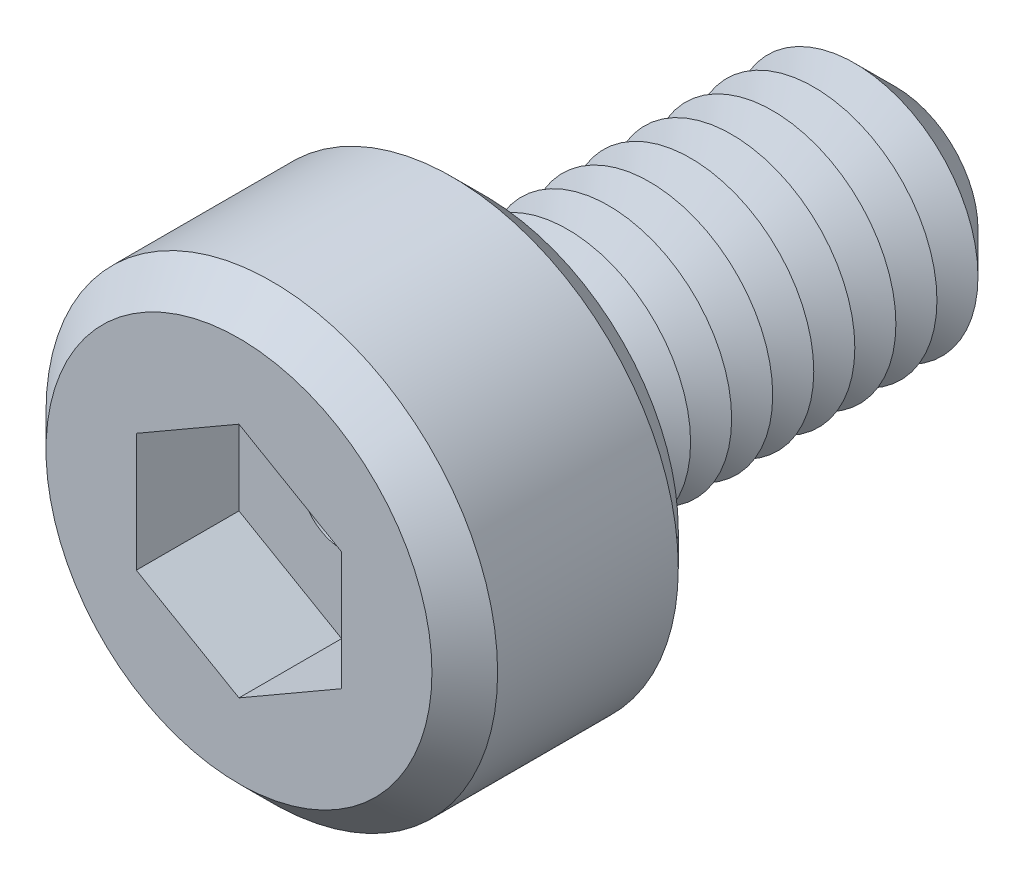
ISO-10303-21;
HEADER;
FILE_DESCRIPTION(('STEP AP214'),'2;1');
FILE_NAME('part.step','',(''),(''),'','','');
FILE_SCHEMA(('AUTOMOTIVE_DESIGN { 1 0 10303 214 1 1 1 1 }'));
ENDSEC;
DATA;
#1=APPLICATION_CONTEXT('core data for automotive mechanical design processes');
#2=APPLICATION_PROTOCOL_DEFINITION('international standard','automotive_design',2000,#1);
#3=PRODUCT_CONTEXT('',#1,'mechanical');
#4=PRODUCT('Part','Part','',(#3));
#5=PRODUCT_RELATED_PRODUCT_CATEGORY('part','',(#4));
#6=PRODUCT_DEFINITION_FORMATION('','',#4);
#7=PRODUCT_DEFINITION_CONTEXT('part definition',#1,'design');
#8=PRODUCT_DEFINITION('design','',#6,#7);
#9=PRODUCT_DEFINITION_SHAPE('','',#8);
#10=(LENGTH_UNIT() NAMED_UNIT(*) SI_UNIT(.MILLI.,.METRE.));
#11=(NAMED_UNIT(*) PLANE_ANGLE_UNIT() SI_UNIT($,.RADIAN.));
#12=(NAMED_UNIT(*) SI_UNIT($,.STERADIAN.) SOLID_ANGLE_UNIT());
#13=UNCERTAINTY_MEASURE_WITH_UNIT(LENGTH_MEASURE(1.E-05),#10,'distance_accuracy_value','');
#14=(GEOMETRIC_REPRESENTATION_CONTEXT(3) GLOBAL_UNCERTAINTY_ASSIGNED_CONTEXT((#13)) GLOBAL_UNIT_ASSIGNED_CONTEXT((#10,
#11,#12)) REPRESENTATION_CONTEXT('',''));
#15=CARTESIAN_POINT('',(0.,0.,0.));
#16=DIRECTION('',(0.,0.,1.));
#17=DIRECTION('',(1.,0.,0.));
#18=AXIS2_PLACEMENT_3D('',#15,#16,#17);
#19=CARTESIAN_POINT('',(0.,0.,3.));
#20=DIRECTION('',(0.,0.,-1.));
#21=DIRECTION('',(-1.,0.,0.));
#22=AXIS2_PLACEMENT_3D('',#19,#20,#21);
#23=CYLINDRICAL_SURFACE('',#22,2.75);
#24=CARTESIAN_POINT('',(0.,0.,0.400000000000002));
#25=DIRECTION('',(0.,0.,1.));
#26=DIRECTION('',(1.,0.,0.));
#27=AXIS2_PLACEMENT_3D('',#24,#25,#26);
#28=CIRCLE('',#27,2.75);
#29=CARTESIAN_POINT('',(2.75,0.,0.400000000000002));
#30=VERTEX_POINT('',#29);
#31=EDGE_CURVE('E248',#30,#30,#28,.T.);
#32=ORIENTED_EDGE('',*,*,#31,.T.);
#33=EDGE_LOOP('',(#32));
#34=FACE_BOUND('',#33,.T.);
#35=CARTESIAN_POINT('',(0.,0.,2.6));
#36=DIRECTION('',(0.,0.,1.));
#37=DIRECTION('',(1.,0.,0.));
#38=AXIS2_PLACEMENT_3D('',#35,#36,#37);
#39=CIRCLE('',#38,2.75);
#40=CARTESIAN_POINT('',(2.75,0.,2.6));
#41=VERTEX_POINT('',#40);
#42=EDGE_CURVE('E244',#41,#41,#39,.F.);
#43=ORIENTED_EDGE('',*,*,#42,.T.);
#44=EDGE_LOOP('',(#43));
#45=FACE_BOUND('',#44,.T.);
#46=ADVANCED_FACE('F39',(#34,#45),#23,.T.);
#47=CARTESIAN_POINT('',(0.,0.,3.));
#48=DIRECTION('',(0.,0.,1.));
#49=DIRECTION('',(1.,0.,0.));
#50=AXIS2_PLACEMENT_3D('',#47,#48,#49);
#51=PLANE('',#50);
#52=CARTESIAN_POINT('',(0.,0.,3.));
#53=DIRECTION('',(0.,0.,1.));
#54=DIRECTION('',(1.,0.,0.));
#55=AXIS2_PLACEMENT_3D('',#52,#53,#54);
#56=CIRCLE('',#55,2.35);
#57=CARTESIAN_POINT('',(2.35,0.,3.));
#58=VERTEX_POINT('',#57);
#59=EDGE_CURVE('E11',#58,#58,#56,.T.);
#60=ORIENTED_EDGE('',*,*,#59,.T.);
#61=EDGE_LOOP('',(#60));
#62=FACE_BOUND('',#61,.T.);
#63=DIRECTION('',(-0.866025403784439,0.5,0.));
#64=VECTOR('',#63,1.);
#65=CARTESIAN_POINT('',(1.25,0.721687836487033,3.));
#66=LINE('',#65,#64);
#67=CARTESIAN_POINT('',(1.25,0.721687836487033,3.));
#68=VERTEX_POINT('',#67);
#69=CARTESIAN_POINT('',(0.,1.44337567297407,3.));
#70=VERTEX_POINT('',#69);
#71=EDGE_CURVE('E55',#68,#70,#66,.T.);
#72=ORIENTED_EDGE('',*,*,#71,.F.);
#73=DIRECTION('',(0.,1.,0.));
#74=VECTOR('',#73,1.);
#75=CARTESIAN_POINT('',(1.25,-0.721687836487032,3.));
#76=LINE('',#75,#74);
#77=CARTESIAN_POINT('',(1.25,-0.721687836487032,3.));
#78=VERTEX_POINT('',#77);
#79=EDGE_CURVE('E151',#78,#68,#76,.T.);
#80=ORIENTED_EDGE('',*,*,#79,.F.);
#81=DIRECTION('',(0.866025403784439,0.5,0.));
#82=VECTOR('',#81,1.);
#83=CARTESIAN_POINT('',(0.,-1.44337567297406,3.));
#84=LINE('',#83,#82);
#85=CARTESIAN_POINT('',(0.,-1.44337567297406,3.));
#86=VERTEX_POINT('',#85);
#87=EDGE_CURVE('E148',#86,#78,#84,.T.);
#88=ORIENTED_EDGE('',*,*,#87,.F.);
#89=DIRECTION('',(0.866025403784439,-0.5,0.));
#90=VECTOR('',#89,1.);
#91=CARTESIAN_POINT('',(-1.25,-0.721687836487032,3.));
#92=LINE('',#91,#90);
#93=CARTESIAN_POINT('',(-1.25,-0.721687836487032,3.));
#94=VERTEX_POINT('',#93);
#95=EDGE_CURVE('E103',#94,#86,#92,.T.);
#96=ORIENTED_EDGE('',*,*,#95,.F.);
#97=DIRECTION('',(0.,-1.,0.));
#98=VECTOR('',#97,1.);
#99=CARTESIAN_POINT('',(-1.25,0.721687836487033,3.));
#100=LINE('',#99,#98);
#101=CARTESIAN_POINT('',(-1.25,0.721687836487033,3.));
#102=VERTEX_POINT('',#101);
#103=EDGE_CURVE('E142',#102,#94,#100,.T.);
#104=ORIENTED_EDGE('',*,*,#103,.F.);
#105=DIRECTION('',(-0.866025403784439,-0.5,0.));
#106=VECTOR('',#105,1.);
#107=CARTESIAN_POINT('',(0.,1.44337567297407,3.));
#108=LINE('',#107,#106);
#109=EDGE_CURVE('E137',#70,#102,#108,.T.);
#110=ORIENTED_EDGE('',*,*,#109,.F.);
#111=EDGE_LOOP('',(#72,#80,#88,#96,#104,#110));
#112=FACE_BOUND('',#111,.T.);
#113=ADVANCED_FACE('F266',(#62,#112),#51,.T.);
#114=CARTESIAN_POINT('',(0.,0.,0.));
#115=DIRECTION('',(0.,0.,1.));
#116=DIRECTION('',(1.,0.,0.));
#117=AXIS2_PLACEMENT_3D('',#114,#115,#116);
#118=PLANE('',#117);
#119=CARTESIAN_POINT('',(0.,0.,0.));
#120=DIRECTION('',(0.,0.,1.));
#121=DIRECTION('',(1.,0.,0.));
#122=AXIS2_PLACEMENT_3D('',#119,#120,#121);
#123=CIRCLE('',#122,2.35);
#124=CARTESIAN_POINT('',(2.35,0.,0.));
#125=VERTEX_POINT('',#124);
#126=EDGE_CURVE('E48',#125,#125,#123,.F.);
#127=ORIENTED_EDGE('',*,*,#126,.T.);
#128=EDGE_LOOP('',(#127));
#129=FACE_BOUND('',#128,.T.);
#130=CARTESIAN_POINT('',(0.,0.,0.));
#131=DIRECTION('',(0.,0.,1.));
#132=DIRECTION('',(1.,0.,0.));
#133=AXIS2_PLACEMENT_3D('',#130,#131,#132);
#134=CIRCLE('',#133,1.5);
#135=CARTESIAN_POINT('',(1.5,0.,0.));
#136=VERTEX_POINT('',#135);
#137=EDGE_CURVE('E236',#136,#136,#134,.T.);
#138=ORIENTED_EDGE('',*,*,#137,.T.);
#139=EDGE_LOOP('',(#138));
#140=FACE_BOUND('',#139,.T.);
#141=ADVANCED_FACE('F255',(#129,#140),#118,.F.);
#142=CARTESIAN_POINT('',(0.,0.,0.));
#143=DIRECTION('',(0.,0.,1.));
#144=DIRECTION('',(1.,0.,0.));
#145=AXIS2_PLACEMENT_3D('',#142,#143,#144);
#146=CONICAL_SURFACE('',#145,1.5,1.0471975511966);
#147=CARTESIAN_POINT('',(0.,0.,-0.25));
#148=DIRECTION('',(0.,0.,1.));
#149=DIRECTION('',(1.,0.,0.));
#150=AXIS2_PLACEMENT_3D('',#147,#148,#149);
#151=CIRCLE('',#150,1.06698729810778);
#152=CARTESIAN_POINT('',(1.06698729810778,0.,-0.25));
#153=VERTEX_POINT('',#152);
#154=EDGE_CURVE('E232',#153,#153,#151,.T.);
#155=ORIENTED_EDGE('',*,*,#154,.T.);
#156=EDGE_LOOP('',(#155));
#157=FACE_BOUND('',#156,.T.);
#158=ORIENTED_EDGE('',*,*,#137,.F.);
#159=EDGE_LOOP('',(#158));
#160=FACE_BOUND('',#159,.T.);
#161=ADVANCED_FACE('F388',(#157,#160),#146,.T.);
#162=CARTESIAN_POINT('',(0.,0.,-0.25));
#163=DIRECTION('',(0.,0.,-1.));
#164=DIRECTION('',(-1.,0.,0.));
#165=AXIS2_PLACEMENT_3D('',#162,#163,#164);
#166=CONICAL_SURFACE('',#165,1.06698729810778,1.0471975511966);
#167=CARTESIAN_POINT('',(0.,0.,-0.5));
#168=DIRECTION('',(0.,0.,1.));
#169=DIRECTION('',(1.,0.,0.));
#170=AXIS2_PLACEMENT_3D('',#167,#168,#169);
#171=CIRCLE('',#170,1.5);
#172=CARTESIAN_POINT('',(1.5,0.,-0.5));
#173=VERTEX_POINT('',#172);
#174=EDGE_CURVE('E228',#173,#173,#171,.T.);
#175=ORIENTED_EDGE('',*,*,#174,.T.);
#176=EDGE_LOOP('',(#175));
#177=FACE_BOUND('',#176,.T.);
#178=ORIENTED_EDGE('',*,*,#154,.F.);
#179=EDGE_LOOP('',(#178));
#180=FACE_BOUND('',#179,.T.);
#181=ADVANCED_FACE('F384',(#177,#180),#166,.T.);
#182=CARTESIAN_POINT('',(0.,0.,-0.5));
#183=DIRECTION('',(0.,0.,1.));
#184=DIRECTION('',(1.,0.,0.));
#185=AXIS2_PLACEMENT_3D('',#182,#183,#184);
#186=CONICAL_SURFACE('',#185,1.5,1.0471975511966);
#187=CARTESIAN_POINT('',(0.,0.,-0.75));
#188=DIRECTION('',(0.,0.,1.));
#189=DIRECTION('',(1.,0.,0.));
#190=AXIS2_PLACEMENT_3D('',#187,#188,#189);
#191=CIRCLE('',#190,1.06698729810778);
#192=CARTESIAN_POINT('',(1.06698729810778,0.,-0.75));
#193=VERTEX_POINT('',#192);
#194=EDGE_CURVE('E224',#193,#193,#191,.T.);
#195=ORIENTED_EDGE('',*,*,#194,.T.);
#196=EDGE_LOOP('',(#195));
#197=FACE_BOUND('',#196,.T.);
#198=ORIENTED_EDGE('',*,*,#174,.F.);
#199=EDGE_LOOP('',(#198));
#200=FACE_BOUND('',#199,.T.);
#201=ADVANCED_FACE('F380',(#197,#200),#186,.T.);
#202=CARTESIAN_POINT('',(0.,0.,-0.75));
#203=DIRECTION('',(0.,0.,-1.));
#204=DIRECTION('',(-1.,0.,0.));
#205=AXIS2_PLACEMENT_3D('',#202,#203,#204);
#206=CONICAL_SURFACE('',#205,1.06698729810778,1.0471975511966);
#207=CARTESIAN_POINT('',(0.,0.,-1.));
#208=DIRECTION('',(0.,0.,1.));
#209=DIRECTION('',(1.,0.,0.));
#210=AXIS2_PLACEMENT_3D('',#207,#208,#209);
#211=CIRCLE('',#210,1.5);
#212=CARTESIAN_POINT('',(1.5,0.,-1.));
#213=VERTEX_POINT('',#212);
#214=EDGE_CURVE('E220',#213,#213,#211,.T.);
#215=ORIENTED_EDGE('',*,*,#214,.T.);
#216=EDGE_LOOP('',(#215));
#217=FACE_BOUND('',#216,.T.);
#218=ORIENTED_EDGE('',*,*,#194,.F.);
#219=EDGE_LOOP('',(#218));
#220=FACE_BOUND('',#219,.T.);
#221=ADVANCED_FACE('F376',(#217,#220),#206,.T.);
#222=CARTESIAN_POINT('',(0.,0.,-1.));
#223=DIRECTION('',(0.,0.,1.));
#224=DIRECTION('',(1.,0.,0.));
#225=AXIS2_PLACEMENT_3D('',#222,#223,#224);
#226=CONICAL_SURFACE('',#225,1.5,1.0471975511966);
#227=CARTESIAN_POINT('',(0.,0.,-1.25));
#228=DIRECTION('',(0.,0.,1.));
#229=DIRECTION('',(1.,0.,0.));
#230=AXIS2_PLACEMENT_3D('',#227,#228,#229);
#231=CIRCLE('',#230,1.06698729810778);
#232=CARTESIAN_POINT('',(1.06698729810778,0.,-1.25));
#233=VERTEX_POINT('',#232);
#234=EDGE_CURVE('E216',#233,#233,#231,.T.);
#235=ORIENTED_EDGE('',*,*,#234,.T.);
#236=EDGE_LOOP('',(#235));
#237=FACE_BOUND('',#236,.T.);
#238=ORIENTED_EDGE('',*,*,#214,.F.);
#239=EDGE_LOOP('',(#238));
#240=FACE_BOUND('',#239,.T.);
#241=ADVANCED_FACE('F372',(#237,#240),#226,.T.);
#242=CARTESIAN_POINT('',(0.,0.,-1.25));
#243=DIRECTION('',(0.,0.,-1.));
#244=DIRECTION('',(-1.,0.,0.));
#245=AXIS2_PLACEMENT_3D('',#242,#243,#244);
#246=CONICAL_SURFACE('',#245,1.06698729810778,1.0471975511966);
#247=CARTESIAN_POINT('',(0.,0.,-1.5));
#248=DIRECTION('',(0.,0.,1.));
#249=DIRECTION('',(1.,0.,0.));
#250=AXIS2_PLACEMENT_3D('',#247,#248,#249);
#251=CIRCLE('',#250,1.5);
#252=CARTESIAN_POINT('',(1.5,0.,-1.5));
#253=VERTEX_POINT('',#252);
#254=EDGE_CURVE('E212',#253,#253,#251,.T.);
#255=ORIENTED_EDGE('',*,*,#254,.T.);
#256=EDGE_LOOP('',(#255));
#257=FACE_BOUND('',#256,.T.);
#258=ORIENTED_EDGE('',*,*,#234,.F.);
#259=EDGE_LOOP('',(#258));
#260=FACE_BOUND('',#259,.T.);
#261=ADVANCED_FACE('F368',(#257,#260),#246,.T.);
#262=CARTESIAN_POINT('',(0.,0.,-1.5));
#263=DIRECTION('',(0.,0.,1.));
#264=DIRECTION('',(1.,0.,0.));
#265=AXIS2_PLACEMENT_3D('',#262,#263,#264);
#266=CONICAL_SURFACE('',#265,1.5,1.0471975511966);
#267=CARTESIAN_POINT('',(0.,0.,-1.75));
#268=DIRECTION('',(0.,0.,1.));
#269=DIRECTION('',(1.,0.,0.));
#270=AXIS2_PLACEMENT_3D('',#267,#268,#269);
#271=CIRCLE('',#270,1.06698729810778);
#272=CARTESIAN_POINT('',(1.06698729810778,0.,-1.75));
#273=VERTEX_POINT('',#272);
#274=EDGE_CURVE('E208',#273,#273,#271,.T.);
#275=ORIENTED_EDGE('',*,*,#274,.T.);
#276=EDGE_LOOP('',(#275));
#277=FACE_BOUND('',#276,.T.);
#278=ORIENTED_EDGE('',*,*,#254,.F.);
#279=EDGE_LOOP('',(#278));
#280=FACE_BOUND('',#279,.T.);
#281=ADVANCED_FACE('F364',(#277,#280),#266,.T.);
#282=CARTESIAN_POINT('',(0.,0.,-1.75));
#283=DIRECTION('',(0.,0.,-1.));
#284=DIRECTION('',(-1.,0.,0.));
#285=AXIS2_PLACEMENT_3D('',#282,#283,#284);
#286=CONICAL_SURFACE('',#285,1.06698729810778,1.0471975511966);
#287=CARTESIAN_POINT('',(0.,0.,-2.));
#288=DIRECTION('',(0.,0.,1.));
#289=DIRECTION('',(1.,0.,0.));
#290=AXIS2_PLACEMENT_3D('',#287,#288,#289);
#291=CIRCLE('',#290,1.5);
#292=CARTESIAN_POINT('',(1.5,0.,-2.));
#293=VERTEX_POINT('',#292);
#294=EDGE_CURVE('E204',#293,#293,#291,.T.);
#295=ORIENTED_EDGE('',*,*,#294,.T.);
#296=EDGE_LOOP('',(#295));
#297=FACE_BOUND('',#296,.T.);
#298=ORIENTED_EDGE('',*,*,#274,.F.);
#299=EDGE_LOOP('',(#298));
#300=FACE_BOUND('',#299,.T.);
#301=ADVANCED_FACE('F360',(#297,#300),#286,.T.);
#302=CARTESIAN_POINT('',(0.,0.,-2.));
#303=DIRECTION('',(0.,0.,1.));
#304=DIRECTION('',(1.,0.,0.));
#305=AXIS2_PLACEMENT_3D('',#302,#303,#304);
#306=CONICAL_SURFACE('',#305,1.5,1.0471975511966);
#307=CARTESIAN_POINT('',(0.,0.,-2.25));
#308=DIRECTION('',(0.,0.,1.));
#309=DIRECTION('',(1.,0.,0.));
#310=AXIS2_PLACEMENT_3D('',#307,#308,#309);
#311=CIRCLE('',#310,1.06698729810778);
#312=CARTESIAN_POINT('',(1.06698729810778,0.,-2.25));
#313=VERTEX_POINT('',#312);
#314=EDGE_CURVE('E200',#313,#313,#311,.T.);
#315=ORIENTED_EDGE('',*,*,#314,.T.);
#316=EDGE_LOOP('',(#315));
#317=FACE_BOUND('',#316,.T.);
#318=ORIENTED_EDGE('',*,*,#294,.F.);
#319=EDGE_LOOP('',(#318));
#320=FACE_BOUND('',#319,.T.);
#321=ADVANCED_FACE('F356',(#317,#320),#306,.T.);
#322=CARTESIAN_POINT('',(0.,0.,-2.25));
#323=DIRECTION('',(0.,0.,-1.));
#324=DIRECTION('',(-1.,0.,0.));
#325=AXIS2_PLACEMENT_3D('',#322,#323,#324);
#326=CONICAL_SURFACE('',#325,1.06698729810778,1.0471975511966);
#327=CARTESIAN_POINT('',(0.,0.,-2.5));
#328=DIRECTION('',(0.,0.,1.));
#329=DIRECTION('',(1.,0.,0.));
#330=AXIS2_PLACEMENT_3D('',#327,#328,#329);
#331=CIRCLE('',#330,1.5);
#332=CARTESIAN_POINT('',(1.5,0.,-2.5));
#333=VERTEX_POINT('',#332);
#334=EDGE_CURVE('E197',#333,#333,#331,.T.);
#335=ORIENTED_EDGE('',*,*,#334,.T.);
#336=EDGE_LOOP('',(#335));
#337=FACE_BOUND('',#336,.T.);
#338=ORIENTED_EDGE('',*,*,#314,.F.);
#339=EDGE_LOOP('',(#338));
#340=FACE_BOUND('',#339,.T.);
#341=ADVANCED_FACE('F352',(#337,#340),#326,.T.);
#342=CARTESIAN_POINT('',(0.,0.,-2.5));
#343=DIRECTION('',(0.,0.,1.));
#344=DIRECTION('',(1.,0.,0.));
#345=AXIS2_PLACEMENT_3D('',#342,#343,#344);
#346=CONICAL_SURFACE('',#345,1.5,1.0471975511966);
#347=CARTESIAN_POINT('',(0.,0.,-2.75));
#348=DIRECTION('',(0.,0.,1.));
#349=DIRECTION('',(1.,0.,0.));
#350=AXIS2_PLACEMENT_3D('',#347,#348,#349);
#351=CIRCLE('',#350,1.06698729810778);
#352=CARTESIAN_POINT('',(1.06698729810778,0.,-2.75));
#353=VERTEX_POINT('',#352);
#354=EDGE_CURVE('E193',#353,#353,#351,.T.);
#355=ORIENTED_EDGE('',*,*,#354,.T.);
#356=EDGE_LOOP('',(#355));
#357=FACE_BOUND('',#356,.T.);
#358=ORIENTED_EDGE('',*,*,#334,.F.);
#359=EDGE_LOOP('',(#358));
#360=FACE_BOUND('',#359,.T.);
#361=ADVANCED_FACE('F348',(#357,#360),#346,.T.);
#362=CARTESIAN_POINT('',(0.,0.,-2.75));
#363=DIRECTION('',(0.,0.,-1.));
#364=DIRECTION('',(-1.,0.,0.));
#365=AXIS2_PLACEMENT_3D('',#362,#363,#364);
#366=CONICAL_SURFACE('',#365,1.06698729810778,1.0471975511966);
#367=CARTESIAN_POINT('',(0.,0.,-3.));
#368=DIRECTION('',(0.,0.,1.));
#369=DIRECTION('',(1.,0.,0.));
#370=AXIS2_PLACEMENT_3D('',#367,#368,#369);
#371=CIRCLE('',#370,1.5);
#372=CARTESIAN_POINT('',(1.5,0.,-3.));
#373=VERTEX_POINT('',#372);
#374=EDGE_CURVE('E190',#373,#373,#371,.T.);
#375=ORIENTED_EDGE('',*,*,#374,.T.);
#376=EDGE_LOOP('',(#375));
#377=FACE_BOUND('',#376,.T.);
#378=ORIENTED_EDGE('',*,*,#354,.F.);
#379=EDGE_LOOP('',(#378));
#380=FACE_BOUND('',#379,.T.);
#381=ADVANCED_FACE('F344',(#377,#380),#366,.T.);
#382=CARTESIAN_POINT('',(0.,0.,-3.));
#383=DIRECTION('',(0.,0.,1.));
#384=DIRECTION('',(1.,0.,0.));
#385=AXIS2_PLACEMENT_3D('',#382,#383,#384);
#386=CONICAL_SURFACE('',#385,1.5,1.0471975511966);
#387=CARTESIAN_POINT('',(0.,0.,-3.25));
#388=DIRECTION('',(0.,0.,1.));
#389=DIRECTION('',(1.,0.,0.));
#390=AXIS2_PLACEMENT_3D('',#387,#388,#389);
#391=CIRCLE('',#390,1.06698729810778);
#392=CARTESIAN_POINT('',(1.06698729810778,0.,-3.25));
#393=VERTEX_POINT('',#392);
#394=EDGE_CURVE('E186',#393,#393,#391,.T.);
#395=ORIENTED_EDGE('',*,*,#394,.T.);
#396=EDGE_LOOP('',(#395));
#397=FACE_BOUND('',#396,.T.);
#398=ORIENTED_EDGE('',*,*,#374,.F.);
#399=EDGE_LOOP('',(#398));
#400=FACE_BOUND('',#399,.T.);
#401=ADVANCED_FACE('F340',(#397,#400),#386,.T.);
#402=CARTESIAN_POINT('',(0.,0.,-3.25));
#403=DIRECTION('',(0.,0.,-1.));
#404=DIRECTION('',(-1.,0.,0.));
#405=AXIS2_PLACEMENT_3D('',#402,#403,#404);
#406=CONICAL_SURFACE('',#405,1.06698729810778,1.0471975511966);
#407=CARTESIAN_POINT('',(0.,0.,-3.5));
#408=DIRECTION('',(0.,0.,1.));
#409=DIRECTION('',(1.,0.,0.));
#410=AXIS2_PLACEMENT_3D('',#407,#408,#409);
#411=CIRCLE('',#410,1.5);
#412=CARTESIAN_POINT('',(1.5,0.,-3.5));
#413=VERTEX_POINT('',#412);
#414=EDGE_CURVE('E182',#413,#413,#411,.T.);
#415=ORIENTED_EDGE('',*,*,#414,.T.);
#416=EDGE_LOOP('',(#415));
#417=FACE_BOUND('',#416,.T.);
#418=ORIENTED_EDGE('',*,*,#394,.F.);
#419=EDGE_LOOP('',(#418));
#420=FACE_BOUND('',#419,.T.);
#421=ADVANCED_FACE('F336',(#417,#420),#406,.T.);
#422=CARTESIAN_POINT('',(0.,0.,-3.5));
#423=DIRECTION('',(0.,0.,1.));
#424=DIRECTION('',(1.,0.,0.));
#425=AXIS2_PLACEMENT_3D('',#422,#423,#424);
#426=CONICAL_SURFACE('',#425,1.5,1.0471975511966);
#427=CARTESIAN_POINT('',(0.,0.,-3.75));
#428=DIRECTION('',(0.,0.,1.));
#429=DIRECTION('',(1.,0.,0.));
#430=AXIS2_PLACEMENT_3D('',#427,#428,#429);
#431=CIRCLE('',#430,1.06698729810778);
#432=CARTESIAN_POINT('',(1.06698729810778,0.,-3.75));
#433=VERTEX_POINT('',#432);
#434=EDGE_CURVE('E178',#433,#433,#431,.T.);
#435=ORIENTED_EDGE('',*,*,#434,.T.);
#436=EDGE_LOOP('',(#435));
#437=FACE_BOUND('',#436,.T.);
#438=ORIENTED_EDGE('',*,*,#414,.F.);
#439=EDGE_LOOP('',(#438));
#440=FACE_BOUND('',#439,.T.);
#441=ADVANCED_FACE('F332',(#437,#440),#426,.T.);
#442=CARTESIAN_POINT('',(0.,0.,-3.75));
#443=DIRECTION('',(0.,0.,-1.));
#444=DIRECTION('',(-1.,0.,0.));
#445=AXIS2_PLACEMENT_3D('',#442,#443,#444);
#446=CONICAL_SURFACE('',#445,1.06698729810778,1.0471975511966);
#447=CARTESIAN_POINT('',(0.,0.,-4.));
#448=DIRECTION('',(0.,0.,1.));
#449=DIRECTION('',(1.,0.,0.));
#450=AXIS2_PLACEMENT_3D('',#447,#448,#449);
#451=CIRCLE('',#450,1.5);
#452=CARTESIAN_POINT('',(1.5,0.,-4.));
#453=VERTEX_POINT('',#452);
#454=EDGE_CURVE('E174',#453,#453,#451,.T.);
#455=ORIENTED_EDGE('',*,*,#454,.T.);
#456=EDGE_LOOP('',(#455));
#457=FACE_BOUND('',#456,.T.);
#458=ORIENTED_EDGE('',*,*,#434,.F.);
#459=EDGE_LOOP('',(#458));
#460=FACE_BOUND('',#459,.T.);
#461=ADVANCED_FACE('F328',(#457,#460),#446,.T.);
#462=CARTESIAN_POINT('',(0.,0.,-4.));
#463=DIRECTION('',(0.,0.,1.));
#464=DIRECTION('',(1.,0.,0.));
#465=AXIS2_PLACEMENT_3D('',#462,#463,#464);
#466=CONICAL_SURFACE('',#465,1.5,1.0471975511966);
#467=CARTESIAN_POINT('',(0.,0.,-4.25));
#468=DIRECTION('',(0.,0.,1.));
#469=DIRECTION('',(1.,0.,0.));
#470=AXIS2_PLACEMENT_3D('',#467,#468,#469);
#471=CIRCLE('',#470,1.06698729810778);
#472=CARTESIAN_POINT('',(1.06698729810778,0.,-4.25));
#473=VERTEX_POINT('',#472);
#474=EDGE_CURVE('E170',#473,#473,#471,.T.);
#475=ORIENTED_EDGE('',*,*,#474,.T.);
#476=EDGE_LOOP('',(#475));
#477=FACE_BOUND('',#476,.T.);
#478=ORIENTED_EDGE('',*,*,#454,.F.);
#479=EDGE_LOOP('',(#478));
#480=FACE_BOUND('',#479,.T.);
#481=ADVANCED_FACE('F324',(#477,#480),#466,.T.);
#482=CARTESIAN_POINT('',(0.,0.,-4.25));
#483=DIRECTION('',(0.,0.,-1.));
#484=DIRECTION('',(-1.,0.,0.));
#485=AXIS2_PLACEMENT_3D('',#482,#483,#484);
#486=CONICAL_SURFACE('',#485,1.06698729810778,1.0471975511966);
#487=CARTESIAN_POINT('',(0.,0.,-4.5));
#488=DIRECTION('',(0.,0.,1.));
#489=DIRECTION('',(1.,0.,0.));
#490=AXIS2_PLACEMENT_3D('',#487,#488,#489);
#491=CIRCLE('',#490,1.5);
#492=CARTESIAN_POINT('',(1.5,0.,-4.5));
#493=VERTEX_POINT('',#492);
#494=EDGE_CURVE('E157',#493,#493,#491,.T.);
#495=ORIENTED_EDGE('',*,*,#494,.T.);
#496=EDGE_LOOP('',(#495));
#497=FACE_BOUND('',#496,.T.);
#498=ORIENTED_EDGE('',*,*,#474,.F.);
#499=EDGE_LOOP('',(#498));
#500=FACE_BOUND('',#499,.T.);
#501=ADVANCED_FACE('F320',(#497,#500),#486,.T.);
#502=CARTESIAN_POINT('',(0.,0.,-5.));
#503=DIRECTION('',(0.,0.,-1.));
#504=DIRECTION('',(-1.,0.,0.));
#505=AXIS2_PLACEMENT_3D('',#502,#503,#504);
#506=PLANE('',#505);
#507=CARTESIAN_POINT('',(0.,0.,-5.));
#508=DIRECTION('',(0.,0.,-1.));
#509=DIRECTION('',(-1.,0.,0.));
#510=AXIS2_PLACEMENT_3D('',#507,#508,#509);
#511=CIRCLE('',#510,0.5);
#512=CARTESIAN_POINT('',(-0.5,0.,-5.));
#513=VERTEX_POINT('',#512);
#514=EDGE_CURVE('E138',#513,#513,#511,.F.);
#515=ORIENTED_EDGE('',*,*,#514,.T.);
#516=EDGE_LOOP('',(#515));
#517=FACE_BOUND('',#516,.T.);
#518=CARTESIAN_POINT('',(0.,0.,-5.));
#519=DIRECTION('',(0.,0.,-1.));
#520=DIRECTION('',(-1.,0.,0.));
#521=AXIS2_PLACEMENT_3D('',#518,#519,#520);
#522=CIRCLE('',#521,0.999999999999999);
#523=CARTESIAN_POINT('',(-0.999999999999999,0.,-5.));
#524=VERTEX_POINT('',#523);
#525=EDGE_CURVE('E240',#524,#524,#522,.T.);
#526=ORIENTED_EDGE('',*,*,#525,.T.);
#527=EDGE_LOOP('',(#526));
#528=FACE_BOUND('',#527,.T.);
#529=ADVANCED_FACE('F323',(#517,#528),#506,.T.);
#530=CARTESIAN_POINT('',(0.,0.,-5.));
#531=DIRECTION('',(0.,0.,1.));
#532=DIRECTION('',(1.,0.,0.));
#533=AXIS2_PLACEMENT_3D('',#530,#531,#532);
#534=CONICAL_SURFACE('',#533,0.999999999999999,0.785398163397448);
#535=ORIENTED_EDGE('',*,*,#494,.F.);
#536=EDGE_LOOP('',(#535));
#537=FACE_BOUND('',#536,.T.);
#538=ORIENTED_EDGE('',*,*,#525,.F.);
#539=EDGE_LOOP('',(#538));
#540=FACE_BOUND('',#539,.T.);
#541=ADVANCED_FACE('F319',(#537,#540),#534,.T.);
#542=CARTESIAN_POINT('',(1.25,0.721687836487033,1.75));
#543=DIRECTION('',(0.5,0.866025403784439,0.));
#544=DIRECTION('',(-0.866025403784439,0.5,0.));
#545=AXIS2_PLACEMENT_3D('',#542,#543,#544);
#546=PLANE('',#545);
#547=ORIENTED_EDGE('',*,*,#71,.T.);
#548=DIRECTION('',(0.,0.,1.));
#549=VECTOR('',#548,1.);
#550=CARTESIAN_POINT('',(0.,1.44337567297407,1.75));
#551=LINE('',#550,#549);
#552=CARTESIAN_POINT('',(0.,1.44337567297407,1.75));
#553=VERTEX_POINT('',#552);
#554=EDGE_CURVE('E85',#553,#70,#551,.T.);
#555=ORIENTED_EDGE('',*,*,#554,.F.);
#556=DIRECTION('',(-0.866025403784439,0.5,0.));
#557=VECTOR('',#556,1.);
#558=CARTESIAN_POINT('',(1.25,0.721687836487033,1.75));
#559=LINE('',#558,#557);
#560=CARTESIAN_POINT('',(1.25,0.721687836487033,1.75));
#561=VERTEX_POINT('',#560);
#562=EDGE_CURVE('E154',#561,#553,#559,.T.);
#563=ORIENTED_EDGE('',*,*,#562,.F.);
#564=DIRECTION('',(0.,0.,1.));
#565=VECTOR('',#564,1.);
#566=CARTESIAN_POINT('',(1.25,0.721687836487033,1.75));
#567=LINE('',#566,#565);
#568=EDGE_CURVE('E63',#561,#68,#567,.T.);
#569=ORIENTED_EDGE('',*,*,#568,.T.);
#570=EDGE_LOOP('',(#547,#555,#563,#569));
#571=FACE_BOUND('',#570,.T.);
#572=ADVANCED_FACE('F309',(#571),#546,.F.);
#573=CARTESIAN_POINT('',(1.25,-0.721687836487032,1.75));
#574=DIRECTION('',(1.,0.,0.));
#575=DIRECTION('',(0.,0.,-1.));
#576=AXIS2_PLACEMENT_3D('',#573,#574,#575);
#577=PLANE('',#576);
#578=ORIENTED_EDGE('',*,*,#79,.T.);
#579=ORIENTED_EDGE('',*,*,#568,.F.);
#580=DIRECTION('',(0.,1.,0.));
#581=VECTOR('',#580,1.);
#582=CARTESIAN_POINT('',(1.25,-0.721687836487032,1.75));
#583=LINE('',#582,#581);
#584=CARTESIAN_POINT('',(1.25,-0.721687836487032,1.75));
#585=VERTEX_POINT('',#584);
#586=EDGE_CURVE('E117',#585,#561,#583,.T.);
#587=ORIENTED_EDGE('',*,*,#586,.F.);
#588=DIRECTION('',(0.,0.,1.));
#589=VECTOR('',#588,1.);
#590=CARTESIAN_POINT('',(1.25,-0.721687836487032,1.75));
#591=LINE('',#590,#589);
#592=EDGE_CURVE('E108',#585,#78,#591,.T.);
#593=ORIENTED_EDGE('',*,*,#592,.T.);
#594=EDGE_LOOP('',(#578,#579,#587,#593));
#595=FACE_BOUND('',#594,.T.);
#596=ADVANCED_FACE('F306',(#595),#577,.F.);
#597=CARTESIAN_POINT('',(0.,-1.44337567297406,1.75));
#598=DIRECTION('',(0.5,-0.866025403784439,0.));
#599=DIRECTION('',(0.866025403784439,0.5,0.));
#600=AXIS2_PLACEMENT_3D('',#597,#598,#599);
#601=PLANE('',#600);
#602=ORIENTED_EDGE('',*,*,#87,.T.);
#603=ORIENTED_EDGE('',*,*,#592,.F.);
#604=DIRECTION('',(0.866025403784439,0.5,0.));
#605=VECTOR('',#604,1.);
#606=CARTESIAN_POINT('',(0.,-1.44337567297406,1.75));
#607=LINE('',#606,#605);
#608=CARTESIAN_POINT('',(0.,-1.44337567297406,1.75));
#609=VERTEX_POINT('',#608);
#610=EDGE_CURVE('E112',#609,#585,#607,.T.);
#611=ORIENTED_EDGE('',*,*,#610,.F.);
#612=DIRECTION('',(0.,0.,1.));
#613=VECTOR('',#612,1.);
#614=CARTESIAN_POINT('',(0.,-1.44337567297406,1.75));
#615=LINE('',#614,#613);
#616=EDGE_CURVE('E96',#609,#86,#615,.T.);
#617=ORIENTED_EDGE('',*,*,#616,.T.);
#618=EDGE_LOOP('',(#602,#603,#611,#617));
#619=FACE_BOUND('',#618,.T.);
#620=ADVANCED_FACE('F113',(#619),#601,.F.);
#621=CARTESIAN_POINT('',(-1.25,-0.721687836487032,1.75));
#622=DIRECTION('',(-0.5,-0.866025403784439,0.));
#623=DIRECTION('',(0.866025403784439,-0.5,0.));
#624=AXIS2_PLACEMENT_3D('',#621,#622,#623);
#625=PLANE('',#624);
#626=ORIENTED_EDGE('',*,*,#95,.T.);
#627=ORIENTED_EDGE('',*,*,#616,.F.);
#628=DIRECTION('',(0.866025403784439,-0.5,0.));
#629=VECTOR('',#628,1.);
#630=CARTESIAN_POINT('',(-1.25,-0.721687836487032,1.75));
#631=LINE('',#630,#629);
#632=CARTESIAN_POINT('',(-1.25,-0.721687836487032,1.75));
#633=VERTEX_POINT('',#632);
#634=EDGE_CURVE('E100',#633,#609,#631,.T.);
#635=ORIENTED_EDGE('',*,*,#634,.F.);
#636=DIRECTION('',(0.,0.,1.));
#637=VECTOR('',#636,1.);
#638=CARTESIAN_POINT('',(-1.25,-0.721687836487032,1.75));
#639=LINE('',#638,#637);
#640=EDGE_CURVE('E109',#633,#94,#639,.T.);
#641=ORIENTED_EDGE('',*,*,#640,.T.);
#642=EDGE_LOOP('',(#626,#627,#635,#641));
#643=FACE_BOUND('',#642,.T.);
#644=ADVANCED_FACE('F98',(#643),#625,.F.);
#645=CARTESIAN_POINT('',(-1.25,0.721687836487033,1.75));
#646=DIRECTION('',(-1.,0.,0.));
#647=DIRECTION('',(0.,0.,1.));
#648=AXIS2_PLACEMENT_3D('',#645,#646,#647);
#649=PLANE('',#648);
#650=ORIENTED_EDGE('',*,*,#103,.T.);
#651=ORIENTED_EDGE('',*,*,#640,.F.);
#652=DIRECTION('',(0.,-1.,0.));
#653=VECTOR('',#652,1.);
#654=CARTESIAN_POINT('',(-1.25,0.721687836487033,1.75));
#655=LINE('',#654,#653);
#656=CARTESIAN_POINT('',(-1.25,0.721687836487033,1.75));
#657=VERTEX_POINT('',#656);
#658=EDGE_CURVE('E123',#657,#633,#655,.T.);
#659=ORIENTED_EDGE('',*,*,#658,.F.);
#660=DIRECTION('',(0.,0.,1.));
#661=VECTOR('',#660,1.);
#662=CARTESIAN_POINT('',(-1.25,0.721687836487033,1.75));
#663=LINE('',#662,#661);
#664=EDGE_CURVE('E162',#657,#102,#663,.T.);
#665=ORIENTED_EDGE('',*,*,#664,.T.);
#666=EDGE_LOOP('',(#650,#651,#659,#665));
#667=FACE_BOUND('',#666,.T.);
#668=ADVANCED_FACE('F303',(#667),#649,.F.);
#669=CARTESIAN_POINT('',(0.,1.44337567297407,1.75));
#670=DIRECTION('',(-0.5,0.866025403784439,0.));
#671=DIRECTION('',(-0.866025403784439,-0.5,0.));
#672=AXIS2_PLACEMENT_3D('',#669,#670,#671);
#673=PLANE('',#672);
#674=ORIENTED_EDGE('',*,*,#109,.T.);
#675=ORIENTED_EDGE('',*,*,#664,.F.);
#676=DIRECTION('',(-0.866025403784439,-0.5,0.));
#677=VECTOR('',#676,1.);
#678=CARTESIAN_POINT('',(0.,1.44337567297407,1.75));
#679=LINE('',#678,#677);
#680=EDGE_CURVE('E129',#553,#657,#679,.T.);
#681=ORIENTED_EDGE('',*,*,#680,.F.);
#682=ORIENTED_EDGE('',*,*,#554,.T.);
#683=EDGE_LOOP('',(#674,#675,#681,#682));
#684=FACE_BOUND('',#683,.T.);
#685=ADVANCED_FACE('F281',(#684),#673,.F.);
#686=CARTESIAN_POINT('',(0.,0.,1.75));
#687=DIRECTION('',(0.,0.,1.));
#688=DIRECTION('',(1.,0.,0.));
#689=AXIS2_PLACEMENT_3D('',#686,#687,#688);
#690=PLANE('',#689);
#691=CARTESIAN_POINT('',(0.,0.,1.75));
#692=DIRECTION('',(0.,0.,1.));
#693=DIRECTION('',(1.,0.,0.));
#694=AXIS2_PLACEMENT_3D('',#691,#692,#693);
#695=CIRCLE('',#694,0.5);
#696=CARTESIAN_POINT('',(0.5,0.,1.75));
#697=VERTEX_POINT('',#696);
#698=EDGE_CURVE('E289',#697,#697,#695,.T.);
#699=ORIENTED_EDGE('',*,*,#698,.F.);
#700=EDGE_LOOP('',(#699));
#701=FACE_BOUND('',#700,.T.);
#702=ORIENTED_EDGE('',*,*,#562,.T.);
#703=ORIENTED_EDGE('',*,*,#680,.T.);
#704=ORIENTED_EDGE('',*,*,#658,.T.);
#705=ORIENTED_EDGE('',*,*,#634,.T.);
#706=ORIENTED_EDGE('',*,*,#610,.T.);
#707=ORIENTED_EDGE('',*,*,#586,.T.);
#708=EDGE_LOOP('',(#702,#703,#704,#705,#706,#707));
#709=FACE_BOUND('',#708,.T.);
#710=ADVANCED_FACE('F120',(#701,#709),#690,.T.);
#711=CARTESIAN_POINT('',(0.,0.,-6.41421356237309));
#712=DIRECTION('',(0.,0.,1.));
#713=DIRECTION('',(1.,0.,0.));
#714=AXIS2_PLACEMENT_3D('',#711,#712,#713);
#715=CYLINDRICAL_SURFACE('',#714,0.5);
#716=ORIENTED_EDGE('',*,*,#698,.T.);
#717=EDGE_LOOP('',(#716));
#718=FACE_BOUND('',#717,.T.);
#719=ORIENTED_EDGE('',*,*,#514,.F.);
#720=EDGE_LOOP('',(#719));
#721=FACE_BOUND('',#720,.T.);
#722=ADVANCED_FACE('F261',(#718,#721),#715,.F.);
#723=CARTESIAN_POINT('',(0.,0.,0.400000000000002));
#724=DIRECTION('',(0.,0.,1.));
#725=DIRECTION('',(1.,0.,0.));
#726=AXIS2_PLACEMENT_3D('',#723,#724,#725);
#727=CONICAL_SURFACE('',#726,2.75,0.785398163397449);
#728=ORIENTED_EDGE('',*,*,#126,.F.);
#729=EDGE_LOOP('',(#728));
#730=FACE_BOUND('',#729,.T.);
#731=ORIENTED_EDGE('',*,*,#31,.F.);
#732=EDGE_LOOP('',(#731));
#733=FACE_BOUND('',#732,.T.);
#734=ADVANCED_FACE('F258',(#730,#733),#727,.T.);
#735=CARTESIAN_POINT('',(0.,0.,3.));
#736=DIRECTION('',(0.,0.,-1.));
#737=DIRECTION('',(-1.,0.,0.));
#738=AXIS2_PLACEMENT_3D('',#735,#736,#737);
#739=CONICAL_SURFACE('',#738,2.35,0.785398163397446);
#740=ORIENTED_EDGE('',*,*,#42,.F.);
#741=EDGE_LOOP('',(#740));
#742=FACE_BOUND('',#741,.T.);
#743=ORIENTED_EDGE('',*,*,#59,.F.);
#744=EDGE_LOOP('',(#743));
#745=FACE_BOUND('',#744,.T.);
#746=ADVANCED_FACE('F41',(#742,#745),#739,.T.);
#747=CLOSED_SHELL('',(#46,#113,#141,#161,#181,#201,#221,#241,#261,#281,#301,#321,#341,#361,#381,
#401,#421,#441,#461,#481,#501,#529,#541,#572,#596,#620,#644,#668,#685,#710,#722,#734,#746));
#748=MANIFOLD_SOLID_BREP('B2',#747);
#749=ADVANCED_BREP_SHAPE_REPRESENTATION('',(#18,#748),#14);
#750=SHAPE_DEFINITION_REPRESENTATION(#9,#749);
ENDSEC;
END-ISO-10303-21;
